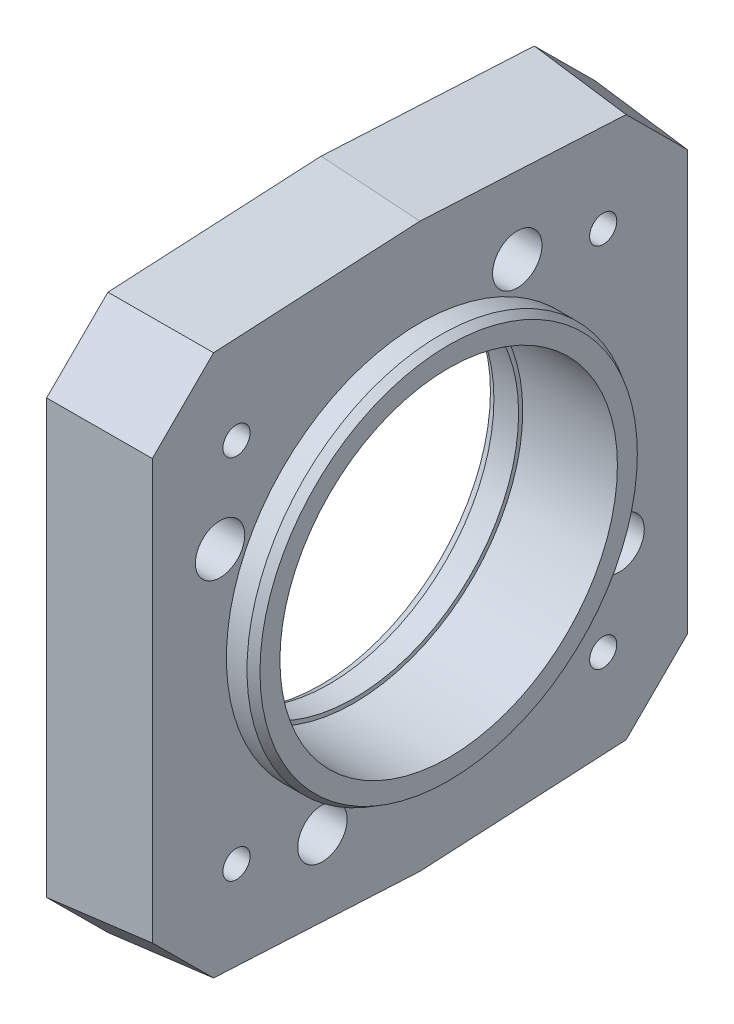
ISO-10303-21;
HEADER;
FILE_DESCRIPTION(('STEP AP214'),'2;1');
FILE_NAME('part.step','',(''),(''),'','','');
FILE_SCHEMA(('AUTOMOTIVE_DESIGN { 1 0 10303 214 1 1 1 1 }'));
ENDSEC;
DATA;
#1=APPLICATION_CONTEXT('core data for automotive mechanical design processes');
#2=APPLICATION_PROTOCOL_DEFINITION('international standard','automotive_design',2000,#1);
#3=PRODUCT_CONTEXT('',#1,'mechanical');
#4=PRODUCT('Part','Part','',(#3));
#5=PRODUCT_RELATED_PRODUCT_CATEGORY('part','',(#4));
#6=PRODUCT_DEFINITION_FORMATION('','',#4);
#7=PRODUCT_DEFINITION_CONTEXT('part definition',#1,'design');
#8=PRODUCT_DEFINITION('design','',#6,#7);
#9=PRODUCT_DEFINITION_SHAPE('','',#8);
#10=(LENGTH_UNIT() NAMED_UNIT(*) SI_UNIT(.MILLI.,.METRE.));
#11=(NAMED_UNIT(*) PLANE_ANGLE_UNIT() SI_UNIT($,.RADIAN.));
#12=(NAMED_UNIT(*) SI_UNIT($,.STERADIAN.) SOLID_ANGLE_UNIT());
#13=UNCERTAINTY_MEASURE_WITH_UNIT(LENGTH_MEASURE(1.E-05),#10,'distance_accuracy_value','');
#14=(GEOMETRIC_REPRESENTATION_CONTEXT(3) GLOBAL_UNCERTAINTY_ASSIGNED_CONTEXT((#13)) GLOBAL_UNIT_ASSIGNED_CONTEXT((#10,
#11,#12)) REPRESENTATION_CONTEXT('',''));
#15=CARTESIAN_POINT('',(0.,0.,0.));
#16=DIRECTION('',(0.,0.,1.));
#17=DIRECTION('',(1.,0.,0.));
#18=AXIS2_PLACEMENT_3D('',#15,#16,#17);
#19=CARTESIAN_POINT('',(-64.5,25.07,-32.));
#20=DIRECTION('',(-1.,0.,0.));
#21=DIRECTION('',(0.,0.,1.));
#22=AXIS2_PLACEMENT_3D('',#19,#20,#21);
#23=PLANE('',#22);
#24=CARTESIAN_POINT('',(-64.5,25.07,-32.));
#25=DIRECTION('',(1.,0.,0.));
#26=DIRECTION('',(0.,0.,-1.));
#27=AXIS2_PLACEMENT_3D('',#24,#25,#26);
#28=CIRCLE('',#27,20.5);
#29=CARTESIAN_POINT('',(-64.5,25.07,-52.5));
#30=VERTEX_POINT('',#29);
#31=EDGE_CURVE('E20',#30,#30,#28,.F.);
#32=ORIENTED_EDGE('',*,*,#31,.T.);
#33=EDGE_LOOP('',(#32));
#34=FACE_BOUND('',#33,.T.);
#35=CARTESIAN_POINT('',(-64.5,25.07,-32.));
#36=DIRECTION('',(-1.,0.,0.));
#37=DIRECTION('',(0.,-1.,0.));
#38=AXIS2_PLACEMENT_3D('',#35,#36,#37);
#39=CIRCLE('',#38,22.9226497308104);
#40=CARTESIAN_POINT('',(-64.5,2.14735026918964,-32.));
#41=VERTEX_POINT('',#40);
#42=EDGE_CURVE('E259',#41,#41,#39,.T.);
#43=ORIENTED_EDGE('',*,*,#42,.F.);
#44=EDGE_LOOP('',(#43));
#45=FACE_BOUND('',#44,.T.);
#46=ADVANCED_FACE('F16',(#34,#45),#23,.F.);
#47=CARTESIAN_POINT('',(-61.,25.07,-32.));
#48=DIRECTION('',(1.,0.,0.));
#49=DIRECTION('',(0.,0.,-1.));
#50=AXIS2_PLACEMENT_3D('',#47,#48,#49);
#51=CYLINDRICAL_SURFACE('',#50,20.5);
#52=ORIENTED_EDGE('',*,*,#31,.F.);
#53=EDGE_LOOP('',(#52));
#54=FACE_BOUND('',#53,.T.);
#55=CARTESIAN_POINT('',(-76.,25.07,-32.));
#56=DIRECTION('',(1.,0.,0.));
#57=DIRECTION('',(0.,0.,-1.));
#58=AXIS2_PLACEMENT_3D('',#55,#56,#57);
#59=CIRCLE('',#58,20.5);
#60=CARTESIAN_POINT('',(-76.,25.07,-52.5));
#61=VERTEX_POINT('',#60);
#62=EDGE_CURVE('E257',#61,#61,#59,.F.);
#63=ORIENTED_EDGE('',*,*,#62,.T.);
#64=EDGE_LOOP('',(#63));
#65=FACE_BOUND('',#64,.T.);
#66=ADVANCED_FACE('F268',(#54,#65),#51,.F.);
#67=CARTESIAN_POINT('',(-65.5,25.07,-32.));
#68=DIRECTION('',(-1.,0.,0.));
#69=DIRECTION('',(0.,-1.,0.));
#70=AXIS2_PLACEMENT_3D('',#67,#68,#69);
#71=CONICAL_SURFACE('',#70,23.5,0.523598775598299);
#72=CARTESIAN_POINT('',(-65.5,25.07,-32.));
#73=DIRECTION('',(1.,0.,0.));
#74=DIRECTION('',(0.,0.,-1.));
#75=AXIS2_PLACEMENT_3D('',#72,#73,#74);
#76=CIRCLE('',#75,23.5);
#77=CARTESIAN_POINT('',(-65.5,25.07,-55.5));
#78=VERTEX_POINT('',#77);
#79=EDGE_CURVE('E256',#78,#78,#76,.F.);
#80=ORIENTED_EDGE('',*,*,#79,.F.);
#81=EDGE_LOOP('',(#80));
#82=FACE_BOUND('',#81,.T.);
#83=ORIENTED_EDGE('',*,*,#42,.T.);
#84=EDGE_LOOP('',(#83));
#85=FACE_BOUND('',#84,.T.);
#86=ADVANCED_FACE('F271',(#82,#85),#71,.T.);
#87=CARTESIAN_POINT('',(-76.,25.07,-32.));
#88=DIRECTION('',(-1.,0.,0.));
#89=DIRECTION('',(0.,0.,1.));
#90=AXIS2_PLACEMENT_3D('',#87,#88,#89);
#91=PLANE('',#90);
#92=ORIENTED_EDGE('',*,*,#62,.F.);
#93=EDGE_LOOP('',(#92));
#94=FACE_BOUND('',#93,.T.);
#95=CARTESIAN_POINT('',(-76.,25.07,-32.));
#96=DIRECTION('',(1.,0.,0.));
#97=DIRECTION('',(0.,0.,-1.));
#98=AXIS2_PLACEMENT_3D('',#95,#96,#97);
#99=CIRCLE('',#98,20.);
#100=CARTESIAN_POINT('',(-76.,25.07,-52.));
#101=VERTEX_POINT('',#100);
#102=EDGE_CURVE('E253',#101,#101,#99,.F.);
#103=ORIENTED_EDGE('',*,*,#102,.T.);
#104=EDGE_LOOP('',(#103));
#105=FACE_BOUND('',#104,.T.);
#106=ADVANCED_FACE('F275',(#94,#105),#91,.F.);
#107=CARTESIAN_POINT('',(-61.4999999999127,49.3374392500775,-43.8360209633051));
#108=DIRECTION('',(1.,0.,0.));
#109=DIRECTION('',(0.,0.,-1.));
#110=AXIS2_PLACEMENT_3D('',#107,#108,#109);
#111=CYLINDRICAL_SURFACE('',#110,3.);
#112=CARTESIAN_POINT('',(-68.,49.3374392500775,-43.8360209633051));
#113=DIRECTION('',(1.,0.,0.));
#114=DIRECTION('',(0.,0.,-1.));
#115=AXIS2_PLACEMENT_3D('',#112,#113,#114);
#116=CIRCLE('',#115,3.);
#117=CARTESIAN_POINT('',(-68.,49.3374392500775,-46.8360209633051));
#118=VERTEX_POINT('',#117);
#119=EDGE_CURVE('E238',#118,#118,#116,.T.);
#120=ORIENTED_EDGE('',*,*,#119,.T.);
#121=EDGE_LOOP('',(#120));
#122=FACE_BOUND('',#121,.T.);
#123=CARTESIAN_POINT('',(-76.,49.3374392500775,-43.8360209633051));
#124=DIRECTION('',(1.,0.,0.));
#125=DIRECTION('',(0.,0.,-1.));
#126=AXIS2_PLACEMENT_3D('',#123,#124,#125);
#127=CIRCLE('',#126,3.);
#128=CARTESIAN_POINT('',(-76.,49.3374392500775,-46.8360209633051));
#129=VERTEX_POINT('',#128);
#130=EDGE_CURVE('E250',#129,#129,#127,.F.);
#131=ORIENTED_EDGE('',*,*,#130,.T.);
#132=EDGE_LOOP('',(#131));
#133=FACE_BOUND('',#132,.T.);
#134=ADVANCED_FACE('F278',(#122,#133),#111,.F.);
#135=CARTESIAN_POINT('',(-61.4999999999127,36.906020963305,-7.73256074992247));
#136=DIRECTION('',(1.,0.,0.));
#137=DIRECTION('',(0.,0.,-1.));
#138=AXIS2_PLACEMENT_3D('',#135,#136,#137);
#139=CYLINDRICAL_SURFACE('',#138,3.);
#140=CARTESIAN_POINT('',(-68.,36.906020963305,-7.73256074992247));
#141=DIRECTION('',(1.,0.,0.));
#142=DIRECTION('',(0.,0.,-1.));
#143=AXIS2_PLACEMENT_3D('',#140,#141,#142);
#144=CIRCLE('',#143,3.);
#145=CARTESIAN_POINT('',(-68.,36.906020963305,-10.7325607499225));
#146=VERTEX_POINT('',#145);
#147=EDGE_CURVE('E235',#146,#146,#144,.T.);
#148=ORIENTED_EDGE('',*,*,#147,.T.);
#149=EDGE_LOOP('',(#148));
#150=FACE_BOUND('',#149,.T.);
#151=CARTESIAN_POINT('',(-76.,36.906020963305,-7.73256074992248));
#152=DIRECTION('',(1.,0.,0.));
#153=DIRECTION('',(0.,0.,-1.));
#154=AXIS2_PLACEMENT_3D('',#151,#152,#153);
#155=CIRCLE('',#154,3.);
#156=CARTESIAN_POINT('',(-76.,36.906020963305,-10.7325607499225));
#157=VERTEX_POINT('',#156);
#158=EDGE_CURVE('E247',#157,#157,#155,.F.);
#159=ORIENTED_EDGE('',*,*,#158,.T.);
#160=EDGE_LOOP('',(#159));
#161=FACE_BOUND('',#160,.T.);
#162=ADVANCED_FACE('F558',(#150,#161),#139,.F.);
#163=CARTESIAN_POINT('',(-61.4999999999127,0.802560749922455,-20.1639790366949));
#164=DIRECTION('',(1.,0.,0.));
#165=DIRECTION('',(0.,0.,-1.));
#166=AXIS2_PLACEMENT_3D('',#163,#164,#165);
#167=CYLINDRICAL_SURFACE('',#166,3.);
#168=CARTESIAN_POINT('',(-68.,0.802560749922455,-20.1639790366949));
#169=DIRECTION('',(1.,0.,0.));
#170=DIRECTION('',(0.,0.,-1.));
#171=AXIS2_PLACEMENT_3D('',#168,#169,#170);
#172=CIRCLE('',#171,3.);
#173=CARTESIAN_POINT('',(-68.,0.802560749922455,-23.1639790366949));
#174=VERTEX_POINT('',#173);
#175=EDGE_CURVE('E232',#174,#174,#172,.T.);
#176=ORIENTED_EDGE('',*,*,#175,.T.);
#177=EDGE_LOOP('',(#176));
#178=FACE_BOUND('',#177,.T.);
#179=CARTESIAN_POINT('',(-76.,0.802560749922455,-20.1639790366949));
#180=DIRECTION('',(1.,0.,0.));
#181=DIRECTION('',(0.,0.,-1.));
#182=AXIS2_PLACEMENT_3D('',#179,#180,#181);
#183=CIRCLE('',#182,3.);
#184=CARTESIAN_POINT('',(-76.,0.802560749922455,-23.1639790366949));
#185=VERTEX_POINT('',#184);
#186=EDGE_CURVE('E244',#185,#185,#183,.F.);
#187=ORIENTED_EDGE('',*,*,#186,.T.);
#188=EDGE_LOOP('',(#187));
#189=FACE_BOUND('',#188,.T.);
#190=ADVANCED_FACE('F550',(#178,#189),#167,.F.);
#191=CARTESIAN_POINT('',(-61.4999999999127,13.2339790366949,-56.2674392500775));
#192=DIRECTION('',(1.,0.,0.));
#193=DIRECTION('',(0.,0.,-1.));
#194=AXIS2_PLACEMENT_3D('',#191,#192,#193);
#195=CYLINDRICAL_SURFACE('',#194,3.);
#196=CARTESIAN_POINT('',(-68.,13.2339790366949,-56.2674392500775));
#197=DIRECTION('',(1.,0.,0.));
#198=DIRECTION('',(0.,0.,-1.));
#199=AXIS2_PLACEMENT_3D('',#196,#197,#198);
#200=CIRCLE('',#199,3.);
#201=CARTESIAN_POINT('',(-68.,13.2339790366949,-59.2674392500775));
#202=VERTEX_POINT('',#201);
#203=EDGE_CURVE('E229',#202,#202,#200,.T.);
#204=ORIENTED_EDGE('',*,*,#203,.T.);
#205=EDGE_LOOP('',(#204));
#206=FACE_BOUND('',#205,.T.);
#207=CARTESIAN_POINT('',(-76.,13.2339790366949,-56.2674392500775));
#208=DIRECTION('',(1.,0.,0.));
#209=DIRECTION('',(0.,0.,-1.));
#210=AXIS2_PLACEMENT_3D('',#207,#208,#209);
#211=CIRCLE('',#210,3.);
#212=CARTESIAN_POINT('',(-76.,13.2339790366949,-59.2674392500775));
#213=VERTEX_POINT('',#212);
#214=EDGE_CURVE('E241',#213,#213,#211,.F.);
#215=ORIENTED_EDGE('',*,*,#214,.T.);
#216=EDGE_LOOP('',(#215));
#217=FACE_BOUND('',#216,.T.);
#218=ADVANCED_FACE('F542',(#206,#217),#195,.F.);
#219=CARTESIAN_POINT('',(-64.5,25.07,-32.));
#220=DIRECTION('',(1.,0.,0.));
#221=DIRECTION('',(0.,0.,-1.));
#222=AXIS2_PLACEMENT_3D('',#219,#220,#221);
#223=CYLINDRICAL_SURFACE('',#222,23.5);
#224=CARTESIAN_POINT('',(-68.,25.07,-32.));
#225=DIRECTION('',(1.,0.,0.));
#226=DIRECTION('',(0.,0.,-1.));
#227=AXIS2_PLACEMENT_3D('',#224,#225,#226);
#228=CIRCLE('',#227,23.5);
#229=CARTESIAN_POINT('',(-68.,25.07,-55.5));
#230=VERTEX_POINT('',#229);
#231=EDGE_CURVE('E226',#230,#230,#228,.T.);
#232=ORIENTED_EDGE('',*,*,#231,.T.);
#233=EDGE_LOOP('',(#232));
#234=FACE_BOUND('',#233,.T.);
#235=ORIENTED_EDGE('',*,*,#79,.T.);
#236=EDGE_LOOP('',(#235));
#237=FACE_BOUND('',#236,.T.);
#238=ADVANCED_FACE('F286',(#234,#237),#223,.T.);
#239=CARTESIAN_POINT('',(-76.,25.07,-32.));
#240=DIRECTION('',(1.,0.,0.));
#241=DIRECTION('',(0.,0.,-1.));
#242=AXIS2_PLACEMENT_3D('',#239,#240,#241);
#243=CYLINDRICAL_SURFACE('',#242,20.);
#244=ORIENTED_EDGE('',*,*,#102,.F.);
#245=EDGE_LOOP('',(#244));
#246=FACE_BOUND('',#245,.T.);
#247=CARTESIAN_POINT('',(-79.,25.07,-32.));
#248=DIRECTION('',(-1.,0.,0.));
#249=DIRECTION('',(0.,0.,1.));
#250=AXIS2_PLACEMENT_3D('',#247,#248,#249);
#251=CIRCLE('',#250,20.);
#252=CARTESIAN_POINT('',(-79.,25.07,-12.));
#253=VERTEX_POINT('',#252);
#254=EDGE_CURVE('E225',#253,#253,#251,.T.);
#255=ORIENTED_EDGE('',*,*,#254,.T.);
#256=EDGE_LOOP('',(#255));
#257=FACE_BOUND('',#256,.T.);
#258=ADVANCED_FACE('F282',(#246,#257),#243,.F.);
#259=CARTESIAN_POINT('',(-76.,49.3374392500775,-43.8360209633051));
#260=DIRECTION('',(1.,0.,0.));
#261=DIRECTION('',(0.,0.,-1.));
#262=AXIS2_PLACEMENT_3D('',#259,#260,#261);
#263=PLANE('',#262);
#264=CARTESIAN_POINT('',(-76.,49.3374392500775,-43.8360209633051));
#265=DIRECTION('',(1.,0.,0.));
#266=DIRECTION('',(0.,0.,-1.));
#267=AXIS2_PLACEMENT_3D('',#264,#265,#266);
#268=CIRCLE('',#267,5.);
#269=CARTESIAN_POINT('',(-76.,49.3374392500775,-48.8360209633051));
#270=VERTEX_POINT('',#269);
#271=EDGE_CURVE('E210',#270,#270,#268,.F.);
#272=ORIENTED_EDGE('',*,*,#271,.T.);
#273=EDGE_LOOP('',(#272));
#274=FACE_BOUND('',#273,.T.);
#275=ORIENTED_EDGE('',*,*,#130,.F.);
#276=EDGE_LOOP('',(#275));
#277=FACE_BOUND('',#276,.T.);
#278=ADVANCED_FACE('F285',(#274,#277),#263,.F.);
#279=CARTESIAN_POINT('',(-76.,36.906020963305,-7.73256074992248));
#280=DIRECTION('',(1.,0.,0.));
#281=DIRECTION('',(0.,0.,-1.));
#282=AXIS2_PLACEMENT_3D('',#279,#280,#281);
#283=PLANE('',#282);
#284=CARTESIAN_POINT('',(-76.,36.906020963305,-7.73256074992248));
#285=DIRECTION('',(1.,0.,0.));
#286=DIRECTION('',(0.,0.,-1.));
#287=AXIS2_PLACEMENT_3D('',#284,#285,#286);
#288=CIRCLE('',#287,5.);
#289=CARTESIAN_POINT('',(-76.,36.906020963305,-12.7325607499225));
#290=VERTEX_POINT('',#289);
#291=EDGE_CURVE('E207',#290,#290,#288,.F.);
#292=ORIENTED_EDGE('',*,*,#291,.T.);
#293=EDGE_LOOP('',(#292));
#294=FACE_BOUND('',#293,.T.);
#295=ORIENTED_EDGE('',*,*,#158,.F.);
#296=EDGE_LOOP('',(#295));
#297=FACE_BOUND('',#296,.T.);
#298=ADVANCED_FACE('F516',(#294,#297),#283,.F.);
#299=CARTESIAN_POINT('',(-76.,0.802560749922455,-20.1639790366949));
#300=DIRECTION('',(1.,0.,0.));
#301=DIRECTION('',(0.,0.,-1.));
#302=AXIS2_PLACEMENT_3D('',#299,#300,#301);
#303=PLANE('',#302);
#304=CARTESIAN_POINT('',(-76.,0.802560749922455,-20.1639790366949));
#305=DIRECTION('',(1.,0.,0.));
#306=DIRECTION('',(0.,0.,-1.));
#307=AXIS2_PLACEMENT_3D('',#304,#305,#306);
#308=CIRCLE('',#307,5.);
#309=CARTESIAN_POINT('',(-76.,0.802560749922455,-25.1639790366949));
#310=VERTEX_POINT('',#309);
#311=EDGE_CURVE('E204',#310,#310,#308,.F.);
#312=ORIENTED_EDGE('',*,*,#311,.T.);
#313=EDGE_LOOP('',(#312));
#314=FACE_BOUND('',#313,.T.);
#315=ORIENTED_EDGE('',*,*,#186,.F.);
#316=EDGE_LOOP('',(#315));
#317=FACE_BOUND('',#316,.T.);
#318=ADVANCED_FACE('F509',(#314,#317),#303,.F.);
#319=CARTESIAN_POINT('',(-76.,13.2339790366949,-56.2674392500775));
#320=DIRECTION('',(1.,0.,0.));
#321=DIRECTION('',(0.,0.,-1.));
#322=AXIS2_PLACEMENT_3D('',#319,#320,#321);
#323=PLANE('',#322);
#324=CARTESIAN_POINT('',(-76.,13.2339790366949,-56.2674392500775));
#325=DIRECTION('',(1.,0.,0.));
#326=DIRECTION('',(0.,0.,-1.));
#327=AXIS2_PLACEMENT_3D('',#324,#325,#326);
#328=CIRCLE('',#327,5.);
#329=CARTESIAN_POINT('',(-76.,13.2339790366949,-61.2674392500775));
#330=VERTEX_POINT('',#329);
#331=EDGE_CURVE('E114',#330,#330,#328,.F.);
#332=ORIENTED_EDGE('',*,*,#331,.T.);
#333=EDGE_LOOP('',(#332));
#334=FACE_BOUND('',#333,.T.);
#335=ORIENTED_EDGE('',*,*,#214,.F.);
#336=EDGE_LOOP('',(#335));
#337=FACE_BOUND('',#336,.T.);
#338=ADVANCED_FACE('F343',(#334,#337),#323,.F.);
#339=CARTESIAN_POINT('',(-68.,57.57,-64.5));
#340=DIRECTION('',(-1.,0.,0.));
#341=DIRECTION('',(0.,0.,1.));
#342=AXIS2_PLACEMENT_3D('',#339,#340,#341);
#343=PLANE('',#342);
#344=DIRECTION('',(0.,-0.705378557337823,-0.708830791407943));
#345=VECTOR('',#344,1.);
#346=CARTESIAN_POINT('',(-68.,50.5537823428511,-64.5009019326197));
#347=LINE('',#346,#345);
#348=CARTESIAN_POINT('',(-68.,50.5546798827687,-64.5));
#349=VERTEX_POINT('',#348);
#350=CARTESIAN_POINT('',(-68.,57.9599955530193,-57.0584415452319));
#351=VERTEX_POINT('',#350);
#352=EDGE_CURVE('E99',#349,#351,#347,.F.);
#353=ORIENTED_EDGE('',*,*,#352,.T.);
#354=DIRECTION('',(0.,0.0523359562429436,0.998629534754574));
#355=VECTOR('',#354,1.);
#356=CARTESIAN_POINT('',(-68.,57.9599955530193,-57.0584415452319));
#357=LINE('',#356,#355);
#358=CARTESIAN_POINT('',(-68.,59.2732528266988,-32.));
#359=VERTEX_POINT('',#358);
#360=EDGE_CURVE('E103',#351,#359,#357,.T.);
#361=ORIENTED_EDGE('',*,*,#360,.T.);
#362=DIRECTION('',(0.,-0.052335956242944,0.998629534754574));
#363=VECTOR('',#362,1.);
#364=CARTESIAN_POINT('',(-68.,59.2732528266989,-32.0000000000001));
#365=LINE('',#364,#363);
#366=CARTESIAN_POINT('',(-68.,57.9599955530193,-6.94155845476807));
#367=VERTEX_POINT('',#366);
#368=EDGE_CURVE('E74',#359,#367,#365,.T.);
#369=ORIENTED_EDGE('',*,*,#368,.T.);
#370=DIRECTION('',(0.,0.705378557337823,-0.708830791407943));
#371=VECTOR('',#370,1.);
#372=CARTESIAN_POINT('',(-68.,57.9590421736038,-6.94060040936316));
#373=LINE('',#372,#371);
#374=CARTESIAN_POINT('',(-68.,50.5546798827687,0.500000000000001));
#375=VERTEX_POINT('',#374);
#376=EDGE_CURVE('E145',#367,#375,#373,.F.);
#377=ORIENTED_EDGE('',*,*,#376,.T.);
#378=DIRECTION('',(0.,1.,0.));
#379=VECTOR('',#378,1.);
#380=CARTESIAN_POINT('',(-68.,-7.43000000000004,0.5));
#381=LINE('',#380,#379);
#382=CARTESIAN_POINT('',(-68.,-0.414679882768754,0.5));
#383=VERTEX_POINT('',#382);
#384=EDGE_CURVE('E141',#375,#383,#381,.F.);
#385=ORIENTED_EDGE('',*,*,#384,.T.);
#386=DIRECTION('',(0.,0.705378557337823,0.708830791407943));
#387=VECTOR('',#386,1.);
#388=CARTESIAN_POINT('',(-68.,-0.413782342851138,0.500901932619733));
#389=LINE('',#388,#387);
#390=CARTESIAN_POINT('',(-68.,-7.81999555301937,-6.94155845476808));
#391=VERTEX_POINT('',#390);
#392=EDGE_CURVE('E137',#383,#391,#389,.F.);
#393=ORIENTED_EDGE('',*,*,#392,.T.);
#394=DIRECTION('',(0.,-0.0523359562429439,-0.998629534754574));
#395=VECTOR('',#394,1.);
#396=CARTESIAN_POINT('',(-68.,-7.81999555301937,-6.94155845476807));
#397=LINE('',#396,#395);
#398=CARTESIAN_POINT('',(-68.,-9.13325282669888,-32.));
#399=VERTEX_POINT('',#398);
#400=EDGE_CURVE('E134',#391,#399,#397,.T.);
#401=ORIENTED_EDGE('',*,*,#400,.T.);
#402=DIRECTION('',(0.,0.0523359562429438,-0.998629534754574));
#403=VECTOR('',#402,1.);
#404=CARTESIAN_POINT('',(-68.,-9.13325282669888,-32.));
#405=LINE('',#404,#403);
#406=CARTESIAN_POINT('',(-68.,-7.81999555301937,-57.0584415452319));
#407=VERTEX_POINT('',#406);
#408=EDGE_CURVE('E128',#399,#407,#405,.T.);
#409=ORIENTED_EDGE('',*,*,#408,.T.);
#410=DIRECTION('',(0.,-0.705378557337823,0.708830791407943));
#411=VECTOR('',#410,1.);
#412=CARTESIAN_POINT('',(-68.,-7.8190421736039,-57.0593995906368));
#413=LINE('',#412,#411);
#414=CARTESIAN_POINT('',(-68.,-0.414679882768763,-64.5));
#415=VERTEX_POINT('',#414);
#416=EDGE_CURVE('E124',#407,#415,#413,.F.);
#417=ORIENTED_EDGE('',*,*,#416,.T.);
#418=DIRECTION('',(0.,1.,0.));
#419=VECTOR('',#418,1.);
#420=CARTESIAN_POINT('',(-68.,57.57,-64.5));
#421=LINE('',#420,#419);
#422=EDGE_CURVE('E105',#415,#349,#421,.T.);
#423=ORIENTED_EDGE('',*,*,#422,.T.);
#424=EDGE_LOOP('',(#353,#361,#369,#377,#385,#393,#401,#409,#417,#423));
#425=FACE_BOUND('',#424,.T.);
#426=ORIENTED_EDGE('',*,*,#231,.F.);
#427=EDGE_LOOP('',(#426));
#428=FACE_BOUND('',#427,.T.);
#429=ORIENTED_EDGE('',*,*,#203,.F.);
#430=EDGE_LOOP('',(#429));
#431=FACE_BOUND('',#430,.T.);
#432=ORIENTED_EDGE('',*,*,#175,.F.);
#433=EDGE_LOOP('',(#432));
#434=FACE_BOUND('',#433,.T.);
#435=ORIENTED_EDGE('',*,*,#147,.F.);
#436=EDGE_LOOP('',(#435));
#437=FACE_BOUND('',#436,.T.);
#438=ORIENTED_EDGE('',*,*,#119,.F.);
#439=EDGE_LOOP('',(#438));
#440=FACE_BOUND('',#439,.T.);
#441=CARTESIAN_POINT('',(-68.,2.79613639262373,-54.2738636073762));
#442=DIRECTION('',(1.,0.,0.));
#443=DIRECTION('',(0.,0.,-1.));
#444=AXIS2_PLACEMENT_3D('',#441,#442,#443);
#445=CIRCLE('',#444,1.65);
#446=CARTESIAN_POINT('',(-68.,2.79613639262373,-55.9238636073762));
#447=VERTEX_POINT('',#446);
#448=EDGE_CURVE('E213',#447,#447,#445,.F.);
#449=ORIENTED_EDGE('',*,*,#448,.T.);
#450=EDGE_LOOP('',(#449));
#451=FACE_BOUND('',#450,.T.);
#452=CARTESIAN_POINT('',(-68.,2.79613639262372,-9.72613639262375));
#453=DIRECTION('',(1.,0.,0.));
#454=DIRECTION('',(0.,0.,-1.));
#455=AXIS2_PLACEMENT_3D('',#452,#453,#454);
#456=CIRCLE('',#455,1.65);
#457=CARTESIAN_POINT('',(-68.,2.79613639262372,-11.3761363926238));
#458=VERTEX_POINT('',#457);
#459=EDGE_CURVE('E216',#458,#458,#456,.F.);
#460=ORIENTED_EDGE('',*,*,#459,.T.);
#461=EDGE_LOOP('',(#460));
#462=FACE_BOUND('',#461,.T.);
#463=CARTESIAN_POINT('',(-68.,47.3438636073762,-9.72613639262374));
#464=DIRECTION('',(1.,0.,0.));
#465=DIRECTION('',(0.,0.,-1.));
#466=AXIS2_PLACEMENT_3D('',#463,#464,#465);
#467=CIRCLE('',#466,1.65);
#468=CARTESIAN_POINT('',(-68.,47.3438636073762,-11.3761363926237));
#469=VERTEX_POINT('',#468);
#470=EDGE_CURVE('E219',#469,#469,#467,.F.);
#471=ORIENTED_EDGE('',*,*,#470,.T.);
#472=EDGE_LOOP('',(#471));
#473=FACE_BOUND('',#472,.T.);
#474=CARTESIAN_POINT('',(-68.,47.3438636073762,-54.2738636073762));
#475=DIRECTION('',(1.,0.,0.));
#476=DIRECTION('',(0.,0.,-1.));
#477=AXIS2_PLACEMENT_3D('',#474,#475,#476);
#478=CIRCLE('',#477,1.65);
#479=CARTESIAN_POINT('',(-68.,47.3438636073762,-55.9238636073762));
#480=VERTEX_POINT('',#479);
#481=EDGE_CURVE('E222',#480,#480,#478,.F.);
#482=ORIENTED_EDGE('',*,*,#481,.T.);
#483=EDGE_LOOP('',(#482));
#484=FACE_BOUND('',#483,.T.);
#485=ADVANCED_FACE('F101',(#425,#428,#431,#434,#437,#440,#451,#462,#473,#484),#343,.F.);
#486=CARTESIAN_POINT('',(-80.,25.07,-32.));
#487=DIRECTION('',(-1.,0.,0.));
#488=DIRECTION('',(0.,-1.,0.));
#489=AXIS2_PLACEMENT_3D('',#486,#487,#488);
#490=CONICAL_SURFACE('',#489,20.5773502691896,0.523598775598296);
#491=ORIENTED_EDGE('',*,*,#254,.F.);
#492=EDGE_LOOP('',(#491));
#493=FACE_BOUND('',#492,.T.);
#494=CARTESIAN_POINT('',(-80.,25.07,-32.));
#495=DIRECTION('',(-1.,0.,0.));
#496=DIRECTION('',(0.,-1.,0.));
#497=AXIS2_PLACEMENT_3D('',#494,#495,#496);
#498=CIRCLE('',#497,20.5773502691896);
#499=CARTESIAN_POINT('',(-80.,4.49264973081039,-32.));
#500=VERTEX_POINT('',#499);
#501=EDGE_CURVE('E151',#500,#500,#498,.F.);
#502=ORIENTED_EDGE('',*,*,#501,.F.);
#503=EDGE_LOOP('',(#502));
#504=FACE_BOUND('',#503,.T.);
#505=ADVANCED_FACE('F332',(#493,#504),#490,.F.);
#506=CARTESIAN_POINT('',(-66.3499999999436,47.3438636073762,-54.2738636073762));
#507=DIRECTION('',(1.,0.,0.));
#508=DIRECTION('',(0.,0.,-1.));
#509=AXIS2_PLACEMENT_3D('',#506,#507,#508);
#510=CYLINDRICAL_SURFACE('',#509,1.65);
#511=ORIENTED_EDGE('',*,*,#481,.F.);
#512=EDGE_LOOP('',(#511));
#513=FACE_BOUND('',#512,.T.);
#514=CARTESIAN_POINT('',(-80.,47.3438636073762,-54.2738636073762));
#515=DIRECTION('',(1.,0.,0.));
#516=DIRECTION('',(0.,0.,-1.));
#517=AXIS2_PLACEMENT_3D('',#514,#515,#516);
#518=CIRCLE('',#517,1.65);
#519=CARTESIAN_POINT('',(-80.,47.3438636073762,-55.9238636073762));
#520=VERTEX_POINT('',#519);
#521=EDGE_CURVE('E197',#520,#520,#518,.T.);
#522=ORIENTED_EDGE('',*,*,#521,.F.);
#523=EDGE_LOOP('',(#522));
#524=FACE_BOUND('',#523,.T.);
#525=ADVANCED_FACE('F334',(#513,#524),#510,.F.);
#526=CARTESIAN_POINT('',(-66.3499999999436,47.3438636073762,-9.72613639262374));
#527=DIRECTION('',(1.,0.,0.));
#528=DIRECTION('',(0.,0.,-1.));
#529=AXIS2_PLACEMENT_3D('',#526,#527,#528);
#530=CYLINDRICAL_SURFACE('',#529,1.65);
#531=ORIENTED_EDGE('',*,*,#470,.F.);
#532=EDGE_LOOP('',(#531));
#533=FACE_BOUND('',#532,.T.);
#534=CARTESIAN_POINT('',(-80.,47.3438636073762,-9.72613639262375));
#535=DIRECTION('',(1.,0.,0.));
#536=DIRECTION('',(0.,0.,-1.));
#537=AXIS2_PLACEMENT_3D('',#534,#535,#536);
#538=CIRCLE('',#537,1.65);
#539=CARTESIAN_POINT('',(-80.,47.3438636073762,-11.3761363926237));
#540=VERTEX_POINT('',#539);
#541=EDGE_CURVE('E194',#540,#540,#538,.T.);
#542=ORIENTED_EDGE('',*,*,#541,.F.);
#543=EDGE_LOOP('',(#542));
#544=FACE_BOUND('',#543,.T.);
#545=ADVANCED_FACE('F340',(#533,#544),#530,.F.);
#546=CARTESIAN_POINT('',(-66.3499999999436,2.79613639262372,-9.72613639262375));
#547=DIRECTION('',(1.,0.,0.));
#548=DIRECTION('',(0.,0.,-1.));
#549=AXIS2_PLACEMENT_3D('',#546,#547,#548);
#550=CYLINDRICAL_SURFACE('',#549,1.65);
#551=ORIENTED_EDGE('',*,*,#459,.F.);
#552=EDGE_LOOP('',(#551));
#553=FACE_BOUND('',#552,.T.);
#554=CARTESIAN_POINT('',(-80.,2.79613639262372,-9.72613639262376));
#555=DIRECTION('',(1.,0.,0.));
#556=DIRECTION('',(0.,0.,-1.));
#557=AXIS2_PLACEMENT_3D('',#554,#555,#556);
#558=CIRCLE('',#557,1.65);
#559=CARTESIAN_POINT('',(-80.,2.79613639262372,-11.3761363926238));
#560=VERTEX_POINT('',#559);
#561=EDGE_CURVE('E191',#560,#560,#558,.T.);
#562=ORIENTED_EDGE('',*,*,#561,.F.);
#563=EDGE_LOOP('',(#562));
#564=FACE_BOUND('',#563,.T.);
#565=ADVANCED_FACE('F349',(#553,#564),#550,.F.);
#566=CARTESIAN_POINT('',(-66.3499999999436,2.79613639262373,-54.2738636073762));
#567=DIRECTION('',(1.,0.,0.));
#568=DIRECTION('',(0.,0.,-1.));
#569=AXIS2_PLACEMENT_3D('',#566,#567,#568);
#570=CYLINDRICAL_SURFACE('',#569,1.65);
#571=ORIENTED_EDGE('',*,*,#448,.F.);
#572=EDGE_LOOP('',(#571));
#573=FACE_BOUND('',#572,.T.);
#574=CARTESIAN_POINT('',(-80.,2.79613639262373,-54.2738636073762));
#575=DIRECTION('',(1.,0.,0.));
#576=DIRECTION('',(0.,0.,-1.));
#577=AXIS2_PLACEMENT_3D('',#574,#575,#576);
#578=CIRCLE('',#577,1.65);
#579=CARTESIAN_POINT('',(-80.,2.79613639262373,-55.9238636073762));
#580=VERTEX_POINT('',#579);
#581=EDGE_CURVE('E188',#580,#580,#578,.T.);
#582=ORIENTED_EDGE('',*,*,#581,.F.);
#583=EDGE_LOOP('',(#582));
#584=FACE_BOUND('',#583,.T.);
#585=ADVANCED_FACE('F353',(#573,#584),#570,.F.);
#586=CARTESIAN_POINT('',(-76.,49.3374392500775,-43.8360209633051));
#587=DIRECTION('',(1.,0.,0.));
#588=DIRECTION('',(0.,0.,-1.));
#589=AXIS2_PLACEMENT_3D('',#586,#587,#588);
#590=CYLINDRICAL_SURFACE('',#589,5.);
#591=ORIENTED_EDGE('',*,*,#271,.F.);
#592=EDGE_LOOP('',(#591));
#593=FACE_BOUND('',#592,.T.);
#594=CARTESIAN_POINT('',(-80.,49.3374392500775,-43.8360209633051));
#595=DIRECTION('',(1.,0.,0.));
#596=DIRECTION('',(0.,0.,-1.));
#597=AXIS2_PLACEMENT_3D('',#594,#595,#596);
#598=CIRCLE('',#597,5.);
#599=CARTESIAN_POINT('',(-80.,49.3374392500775,-48.8360209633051));
#600=VERTEX_POINT('',#599);
#601=EDGE_CURVE('E185',#600,#600,#598,.T.);
#602=ORIENTED_EDGE('',*,*,#601,.F.);
#603=EDGE_LOOP('',(#602));
#604=FACE_BOUND('',#603,.T.);
#605=ADVANCED_FACE('F357',(#593,#604),#590,.F.);
#606=CARTESIAN_POINT('',(-76.,36.906020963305,-7.73256074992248));
#607=DIRECTION('',(1.,0.,0.));
#608=DIRECTION('',(0.,0.,-1.));
#609=AXIS2_PLACEMENT_3D('',#606,#607,#608);
#610=CYLINDRICAL_SURFACE('',#609,5.);
#611=ORIENTED_EDGE('',*,*,#291,.F.);
#612=EDGE_LOOP('',(#611));
#613=FACE_BOUND('',#612,.T.);
#614=CARTESIAN_POINT('',(-80.,36.906020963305,-7.73256074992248));
#615=DIRECTION('',(1.,0.,0.));
#616=DIRECTION('',(0.,0.,-1.));
#617=AXIS2_PLACEMENT_3D('',#614,#615,#616);
#618=CIRCLE('',#617,5.);
#619=CARTESIAN_POINT('',(-80.,36.906020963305,-12.7325607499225));
#620=VERTEX_POINT('',#619);
#621=EDGE_CURVE('E182',#620,#620,#618,.T.);
#622=ORIENTED_EDGE('',*,*,#621,.F.);
#623=EDGE_LOOP('',(#622));
#624=FACE_BOUND('',#623,.T.);
#625=ADVANCED_FACE('F361',(#613,#624),#610,.F.);
#626=CARTESIAN_POINT('',(-76.,0.802560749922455,-20.1639790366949));
#627=DIRECTION('',(1.,0.,0.));
#628=DIRECTION('',(0.,0.,-1.));
#629=AXIS2_PLACEMENT_3D('',#626,#627,#628);
#630=CYLINDRICAL_SURFACE('',#629,5.);
#631=ORIENTED_EDGE('',*,*,#311,.F.);
#632=EDGE_LOOP('',(#631));
#633=FACE_BOUND('',#632,.T.);
#634=CARTESIAN_POINT('',(-80.,0.802560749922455,-20.1639790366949));
#635=DIRECTION('',(1.,0.,0.));
#636=DIRECTION('',(0.,0.,-1.));
#637=AXIS2_PLACEMENT_3D('',#634,#635,#636);
#638=CIRCLE('',#637,5.);
#639=CARTESIAN_POINT('',(-80.,0.802560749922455,-25.1639790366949));
#640=VERTEX_POINT('',#639);
#641=EDGE_CURVE('E179',#640,#640,#638,.T.);
#642=ORIENTED_EDGE('',*,*,#641,.F.);
#643=EDGE_LOOP('',(#642));
#644=FACE_BOUND('',#643,.T.);
#645=ADVANCED_FACE('F365',(#633,#644),#630,.F.);
#646=CARTESIAN_POINT('',(-76.,13.2339790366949,-56.2674392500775));
#647=DIRECTION('',(1.,0.,0.));
#648=DIRECTION('',(0.,0.,-1.));
#649=AXIS2_PLACEMENT_3D('',#646,#647,#648);
#650=CYLINDRICAL_SURFACE('',#649,5.);
#651=ORIENTED_EDGE('',*,*,#331,.F.);
#652=EDGE_LOOP('',(#651));
#653=FACE_BOUND('',#652,.T.);
#654=CARTESIAN_POINT('',(-80.,13.2339790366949,-56.2674392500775));
#655=DIRECTION('',(1.,0.,0.));
#656=DIRECTION('',(0.,0.,-1.));
#657=AXIS2_PLACEMENT_3D('',#654,#655,#656);
#658=CIRCLE('',#657,5.);
#659=CARTESIAN_POINT('',(-80.,13.2339790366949,-61.2674392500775));
#660=VERTEX_POINT('',#659);
#661=EDGE_CURVE('E176',#660,#660,#658,.T.);
#662=ORIENTED_EDGE('',*,*,#661,.F.);
#663=EDGE_LOOP('',(#662));
#664=FACE_BOUND('',#663,.T.);
#665=ADVANCED_FACE('F369',(#653,#664),#650,.F.);
#666=CARTESIAN_POINT('',(-68.,59.2732528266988,-32.));
#667=DIRECTION('',(-0.0697564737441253,-0.996196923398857,0.052208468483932));
#668=DIRECTION('',(0.997557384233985,-0.0698517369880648,0.));
#669=AXIS2_PLACEMENT_3D('',#666,#667,#668);
#670=PLANE('',#669);
#671=DIRECTION('',(-0.995385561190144,0.0660518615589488,-0.0696041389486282));
#672=VECTOR('',#671,1.);
#673=CARTESIAN_POINT('',(-68.,57.9599955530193,-57.0584415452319));
#674=LINE('',#673,#672);
#675=CARTESIAN_POINT('',(-80.,58.756292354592,-57.897563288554));
#676=VERTEX_POINT('',#675);
#677=EDGE_CURVE('E109',#351,#676,#674,.T.);
#678=ORIENTED_EDGE('',*,*,#677,.T.);
#679=DIRECTION('',(0.,-0.0523359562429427,-0.998629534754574));
#680=VECTOR('',#679,1.);
#681=CARTESIAN_POINT('',(-80.,60.1135261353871,-32.0000000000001));
#682=LINE('',#681,#680);
#683=CARTESIAN_POINT('',(-80.,60.1135261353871,-32.0000000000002));
#684=VERTEX_POINT('',#683);
#685=EDGE_CURVE('E67',#684,#676,#682,.T.);
#686=ORIENTED_EDGE('',*,*,#685,.F.);
#687=DIRECTION('',(0.997557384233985,-0.0698517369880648,0.));
#688=VECTOR('',#687,1.);
#689=CARTESIAN_POINT('',(-67.8813154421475,59.2649422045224,-32.0000000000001));
#690=LINE('',#689,#688);
#691=EDGE_CURVE('E113',#684,#359,#690,.T.);
#692=ORIENTED_EDGE('',*,*,#691,.T.);
#693=ORIENTED_EDGE('',*,*,#360,.F.);
#694=EDGE_LOOP('',(#678,#686,#692,#693));
#695=FACE_BOUND('',#694,.T.);
#696=ADVANCED_FACE('F111',(#695),#670,.F.);
#697=CARTESIAN_POINT('',(-68.4612367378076,50.5852866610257,-64.5322528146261));
#698=DIRECTION('',(-0.0959172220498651,-0.705562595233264,0.702126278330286));
#699=DIRECTION('',(0.,-0.705378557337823,-0.708830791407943));
#700=AXIS2_PLACEMENT_3D('',#697,#698,#699);
#701=PLANE('',#700);
#702=ORIENTED_EDGE('',*,*,#677,.F.);
#703=ORIENTED_EDGE('',*,*,#352,.F.);
#704=DIRECTION('',(-0.995385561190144,0.0660518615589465,-0.0696041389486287));
#705=VECTOR('',#704,1.);
#706=CARTESIAN_POINT('',(-68.,50.5546798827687,-64.5));
#707=LINE('',#706,#705);
#708=CARTESIAN_POINT('',(-80.,51.3509766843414,-65.3391217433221));
#709=VERTEX_POINT('',#708);
#710=EDGE_CURVE('E120',#349,#709,#707,.T.);
#711=ORIENTED_EDGE('',*,*,#710,.T.);
#712=DIRECTION('',(0.,-0.705378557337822,-0.708830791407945));
#713=VECTOR('',#712,1.);
#714=CARTESIAN_POINT('',(-80.,58.756292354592,-57.897563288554));
#715=LINE('',#714,#713);
#716=EDGE_CURVE('E118',#676,#709,#715,.T.);
#717=ORIENTED_EDGE('',*,*,#716,.F.);
#718=EDGE_LOOP('',(#702,#703,#711,#717));
#719=FACE_BOUND('',#718,.T.);
#720=ADVANCED_FACE('F116',(#719),#701,.F.);
#721=CARTESIAN_POINT('',(-68.,57.57,-64.5));
#722=DIRECTION('',(-0.0697564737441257,0.,0.997564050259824));
#723=DIRECTION('',(0.997564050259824,0.,0.0697564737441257));
#724=AXIS2_PLACEMENT_3D('',#721,#722,#723);
#725=PLANE('',#724);
#726=ORIENTED_EDGE('',*,*,#710,.F.);
#727=ORIENTED_EDGE('',*,*,#422,.F.);
#728=DIRECTION('',(-0.995385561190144,-0.0660518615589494,-0.0696041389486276));
#729=VECTOR('',#728,1.);
#730=CARTESIAN_POINT('',(-68.,-0.414679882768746,-64.5));
#731=LINE('',#730,#729);
#732=CARTESIAN_POINT('',(-80.,-1.21097668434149,-65.3391217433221));
#733=VERTEX_POINT('',#732);
#734=EDGE_CURVE('E126',#415,#733,#731,.T.);
#735=ORIENTED_EDGE('',*,*,#734,.T.);
#736=DIRECTION('',(0.,1.,0.));
#737=VECTOR('',#736,1.);
#738=CARTESIAN_POINT('',(-80.,57.57,-65.3391217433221));
#739=LINE('',#738,#737);
#740=EDGE_CURVE('E171',#709,#733,#739,.F.);
#741=ORIENTED_EDGE('',*,*,#740,.F.);
#742=EDGE_LOOP('',(#726,#727,#735,#741));
#743=FACE_BOUND('',#742,.T.);
#744=ADVANCED_FACE('F378',(#743),#725,.F.);
#745=CARTESIAN_POINT('',(-68.4899320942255,-7.85250649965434,-57.0927009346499));
#746=DIRECTION('',(-0.0959172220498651,0.705562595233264,0.702126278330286));
#747=DIRECTION('',(0.,-0.705378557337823,0.708830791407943));
#748=AXIS2_PLACEMENT_3D('',#745,#746,#747);
#749=PLANE('',#748);
#750=ORIENTED_EDGE('',*,*,#734,.F.);
#751=ORIENTED_EDGE('',*,*,#416,.F.);
#752=DIRECTION('',(-0.995385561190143,-0.0660518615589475,-0.069604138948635));
#753=VECTOR('',#752,1.);
#754=CARTESIAN_POINT('',(-68.,-7.81999555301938,-57.0584415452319));
#755=LINE('',#754,#753);
#756=CARTESIAN_POINT('',(-80.,-8.61629235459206,-57.8975632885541));
#757=VERTEX_POINT('',#756);
#758=EDGE_CURVE('E130',#407,#757,#755,.T.);
#759=ORIENTED_EDGE('',*,*,#758,.T.);
#760=DIRECTION('',(0.,-0.705378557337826,0.70883079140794));
#761=VECTOR('',#760,1.);
#762=CARTESIAN_POINT('',(-80.,-1.21097668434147,-65.3391217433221));
#763=LINE('',#762,#761);
#764=EDGE_CURVE('E168',#733,#757,#763,.T.);
#765=ORIENTED_EDGE('',*,*,#764,.F.);
#766=EDGE_LOOP('',(#750,#751,#759,#765));
#767=FACE_BOUND('',#766,.T.);
#768=ADVANCED_FACE('F381',(#767),#749,.F.);
#769=CARTESIAN_POINT('',(-68.,-7.43000000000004,-64.5));
#770=DIRECTION('',(-0.0697564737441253,0.996196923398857,0.052208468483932));
#771=DIRECTION('',(-0.997557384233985,-0.0698517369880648,0.));
#772=AXIS2_PLACEMENT_3D('',#769,#770,#771);
#773=PLANE('',#772);
#774=ORIENTED_EDGE('',*,*,#758,.F.);
#775=ORIENTED_EDGE('',*,*,#408,.F.);
#776=DIRECTION('',(-0.997557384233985,-0.0698517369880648,0.));
#777=VECTOR('',#776,1.);
#778=CARTESIAN_POINT('',(-68.,-9.13325282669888,-32.));
#779=LINE('',#778,#777);
#780=CARTESIAN_POINT('',(-80.,-9.97352613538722,-31.9999999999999));
#781=VERTEX_POINT('',#780);
#782=EDGE_CURVE('E132',#399,#781,#779,.T.);
#783=ORIENTED_EDGE('',*,*,#782,.T.);
#784=DIRECTION('',(0.,-0.0523359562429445,0.998629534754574));
#785=VECTOR('',#784,1.);
#786=CARTESIAN_POINT('',(-80.,-8.61629235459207,-57.8975632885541));
#787=LINE('',#786,#785);
#788=EDGE_CURVE('E165',#757,#781,#787,.T.);
#789=ORIENTED_EDGE('',*,*,#788,.F.);
#790=EDGE_LOOP('',(#774,#775,#783,#789));
#791=FACE_BOUND('',#790,.T.);
#792=ADVANCED_FACE('F385',(#791),#773,.F.);
#793=CARTESIAN_POINT('',(-68.,-9.13325282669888,-32.));
#794=DIRECTION('',(-0.0697564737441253,0.996196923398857,-0.052208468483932));
#795=DIRECTION('',(-0.997557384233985,-0.0698517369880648,0.));
#796=AXIS2_PLACEMENT_3D('',#793,#794,#795);
#797=PLANE('',#796);
#798=DIRECTION('',(-0.995385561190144,-0.0660518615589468,0.0696041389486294));
#799=VECTOR('',#798,1.);
#800=CARTESIAN_POINT('',(-68.,-7.81999555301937,-6.94155845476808));
#801=LINE('',#800,#799);
#802=CARTESIAN_POINT('',(-80.,-8.61629235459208,-6.10243671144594));
#803=VERTEX_POINT('',#802);
#804=EDGE_CURVE('E139',#391,#803,#801,.T.);
#805=ORIENTED_EDGE('',*,*,#804,.T.);
#806=DIRECTION('',(0.,0.0523359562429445,0.998629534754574));
#807=VECTOR('',#806,1.);
#808=CARTESIAN_POINT('',(-80.,-9.97352613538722,-32.));
#809=LINE('',#808,#807);
#810=EDGE_CURVE('E162',#781,#803,#809,.T.);
#811=ORIENTED_EDGE('',*,*,#810,.F.);
#812=ORIENTED_EDGE('',*,*,#782,.F.);
#813=ORIENTED_EDGE('',*,*,#400,.F.);
#814=EDGE_LOOP('',(#805,#811,#812,#813));
#815=FACE_BOUND('',#814,.T.);
#816=ADVANCED_FACE('F389',(#815),#797,.F.);
#817=CARTESIAN_POINT('',(-68.4612367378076,-0.445286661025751,0.532252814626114));
#818=DIRECTION('',(-0.0959172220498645,0.705562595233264,-0.702126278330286));
#819=DIRECTION('',(0.,0.705378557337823,0.708830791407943));
#820=AXIS2_PLACEMENT_3D('',#817,#818,#819);
#821=PLANE('',#820);
#822=ORIENTED_EDGE('',*,*,#804,.F.);
#823=ORIENTED_EDGE('',*,*,#392,.F.);
#824=DIRECTION('',(-0.995385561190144,-0.0660518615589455,0.0696041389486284));
#825=VECTOR('',#824,1.);
#826=CARTESIAN_POINT('',(-68.,-0.414679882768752,0.5));
#827=LINE('',#826,#825);
#828=CARTESIAN_POINT('',(-80.,-1.21097668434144,1.33912174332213));
#829=VERTEX_POINT('',#828);
#830=EDGE_CURVE('E143',#383,#829,#827,.T.);
#831=ORIENTED_EDGE('',*,*,#830,.T.);
#832=DIRECTION('',(0.,0.705378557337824,0.708830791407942));
#833=VECTOR('',#832,1.);
#834=CARTESIAN_POINT('',(-80.,-8.61629235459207,-6.10243671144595));
#835=LINE('',#834,#833);
#836=EDGE_CURVE('E159',#803,#829,#835,.T.);
#837=ORIENTED_EDGE('',*,*,#836,.F.);
#838=EDGE_LOOP('',(#822,#823,#831,#837));
#839=FACE_BOUND('',#838,.T.);
#840=ADVANCED_FACE('F393',(#839),#821,.F.);
#841=CARTESIAN_POINT('',(-68.,-7.43000000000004,0.5));
#842=DIRECTION('',(-0.0697564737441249,0.,-0.997564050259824));
#843=DIRECTION('',(-0.997564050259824,0.,0.0697564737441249));
#844=AXIS2_PLACEMENT_3D('',#841,#842,#843);
#845=PLANE('',#844);
#846=ORIENTED_EDGE('',*,*,#830,.F.);
#847=ORIENTED_EDGE('',*,*,#384,.F.);
#848=DIRECTION('',(-0.995385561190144,0.0660518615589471,0.0696041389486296));
#849=VECTOR('',#848,1.);
#850=CARTESIAN_POINT('',(-68.,50.5546798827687,0.500000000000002));
#851=LINE('',#850,#849);
#852=CARTESIAN_POINT('',(-80.,51.3509766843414,1.33912174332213));
#853=VERTEX_POINT('',#852);
#854=EDGE_CURVE('E147',#375,#853,#851,.T.);
#855=ORIENTED_EDGE('',*,*,#854,.T.);
#856=DIRECTION('',(0.,1.,0.));
#857=VECTOR('',#856,1.);
#858=CARTESIAN_POINT('',(-80.,57.57,1.33912174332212));
#859=LINE('',#858,#857);
#860=EDGE_CURVE('E156',#829,#853,#859,.T.);
#861=ORIENTED_EDGE('',*,*,#860,.F.);
#862=EDGE_LOOP('',(#846,#847,#855,#861));
#863=FACE_BOUND('',#862,.T.);
#864=ADVANCED_FACE('F397',(#863),#845,.F.);
#865=CARTESIAN_POINT('',(-68.4899320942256,57.9925064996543,-6.90729906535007));
#866=DIRECTION('',(-0.0959172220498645,-0.705562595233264,-0.702126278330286));
#867=DIRECTION('',(0.,0.705378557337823,-0.708830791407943));
#868=AXIS2_PLACEMENT_3D('',#865,#866,#867);
#869=PLANE('',#868);
#870=ORIENTED_EDGE('',*,*,#854,.F.);
#871=ORIENTED_EDGE('',*,*,#376,.F.);
#872=DIRECTION('',(-0.995385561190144,0.0660518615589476,0.0696041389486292));
#873=VECTOR('',#872,1.);
#874=CARTESIAN_POINT('',(-68.,57.9599955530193,-6.94155845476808));
#875=LINE('',#874,#873);
#876=CARTESIAN_POINT('',(-80.,58.756292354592,-6.10243671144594));
#877=VERTEX_POINT('',#876);
#878=EDGE_CURVE('E35',#367,#877,#875,.T.);
#879=ORIENTED_EDGE('',*,*,#878,.T.);
#880=DIRECTION('',(0.,0.705378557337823,-0.708830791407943));
#881=VECTOR('',#880,1.);
#882=CARTESIAN_POINT('',(-80.,51.3509766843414,1.33912174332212));
#883=LINE('',#882,#881);
#884=EDGE_CURVE('E26',#853,#877,#883,.T.);
#885=ORIENTED_EDGE('',*,*,#884,.F.);
#886=EDGE_LOOP('',(#870,#871,#879,#885));
#887=FACE_BOUND('',#886,.T.);
#888=ADVANCED_FACE('F311',(#887),#869,.F.);
#889=CARTESIAN_POINT('',(-68.,57.57,0.499999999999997));
#890=DIRECTION('',(-0.0697564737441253,-0.996196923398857,-0.052208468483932));
#891=DIRECTION('',(0.997557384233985,-0.0698517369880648,0.));
#892=AXIS2_PLACEMENT_3D('',#889,#890,#891);
#893=PLANE('',#892);
#894=ORIENTED_EDGE('',*,*,#878,.F.);
#895=ORIENTED_EDGE('',*,*,#368,.F.);
#896=ORIENTED_EDGE('',*,*,#691,.F.);
#897=DIRECTION('',(0.,0.0523359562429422,-0.998629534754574));
#898=VECTOR('',#897,1.);
#899=CARTESIAN_POINT('',(-80.,58.756292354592,-6.10243671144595));
#900=LINE('',#899,#898);
#901=EDGE_CURVE('E10',#877,#684,#900,.T.);
#902=ORIENTED_EDGE('',*,*,#901,.F.);
#903=EDGE_LOOP('',(#894,#895,#896,#902));
#904=FACE_BOUND('',#903,.T.);
#905=ADVANCED_FACE('F306',(#904),#893,.F.);
#906=CARTESIAN_POINT('',(-80.,57.57,-64.5));
#907=DIRECTION('',(-1.,0.,0.));
#908=DIRECTION('',(0.,0.,1.));
#909=AXIS2_PLACEMENT_3D('',#906,#907,#908);
#910=PLANE('',#909);
#911=ORIENTED_EDGE('',*,*,#884,.T.);
#912=ORIENTED_EDGE('',*,*,#901,.T.);
#913=ORIENTED_EDGE('',*,*,#685,.T.);
#914=ORIENTED_EDGE('',*,*,#716,.T.);
#915=ORIENTED_EDGE('',*,*,#740,.T.);
#916=ORIENTED_EDGE('',*,*,#764,.T.);
#917=ORIENTED_EDGE('',*,*,#788,.T.);
#918=ORIENTED_EDGE('',*,*,#810,.T.);
#919=ORIENTED_EDGE('',*,*,#836,.T.);
#920=ORIENTED_EDGE('',*,*,#860,.T.);
#921=EDGE_LOOP('',(#911,#912,#913,#914,#915,#916,#917,#918,#919,#920));
#922=FACE_BOUND('',#921,.T.);
#923=ORIENTED_EDGE('',*,*,#661,.T.);
#924=EDGE_LOOP('',(#923));
#925=FACE_BOUND('',#924,.T.);
#926=ORIENTED_EDGE('',*,*,#641,.T.);
#927=EDGE_LOOP('',(#926));
#928=FACE_BOUND('',#927,.T.);
#929=ORIENTED_EDGE('',*,*,#621,.T.);
#930=EDGE_LOOP('',(#929));
#931=FACE_BOUND('',#930,.T.);
#932=ORIENTED_EDGE('',*,*,#601,.T.);
#933=EDGE_LOOP('',(#932));
#934=FACE_BOUND('',#933,.T.);
#935=ORIENTED_EDGE('',*,*,#581,.T.);
#936=EDGE_LOOP('',(#935));
#937=FACE_BOUND('',#936,.T.);
#938=ORIENTED_EDGE('',*,*,#561,.T.);
#939=EDGE_LOOP('',(#938));
#940=FACE_BOUND('',#939,.T.);
#941=ORIENTED_EDGE('',*,*,#541,.T.);
#942=EDGE_LOOP('',(#941));
#943=FACE_BOUND('',#942,.T.);
#944=ORIENTED_EDGE('',*,*,#521,.T.);
#945=EDGE_LOOP('',(#944));
#946=FACE_BOUND('',#945,.T.);
#947=ORIENTED_EDGE('',*,*,#501,.T.);
#948=EDGE_LOOP('',(#947));
#949=FACE_BOUND('',#948,.T.);
#950=ADVANCED_FACE('F18',(#922,#925,#928,#931,#934,#937,#940,#943,#946,#949),#910,.T.);
#951=CLOSED_SHELL('',(#46,#66,#86,#106,#134,#162,#190,#218,#238,#258,#278,#298,#318,#338,#485,
#505,#525,#545,#565,#585,#605,#625,#645,#665,#696,#720,#744,#768,#792,#816,#840,#864,#888,#905,#950));
#952=MANIFOLD_SOLID_BREP('B1',#951);
#953=ADVANCED_BREP_SHAPE_REPRESENTATION('',(#18,#952),#14);
#954=SHAPE_DEFINITION_REPRESENTATION(#9,#953);
ENDSEC;
END-ISO-10303-21;
